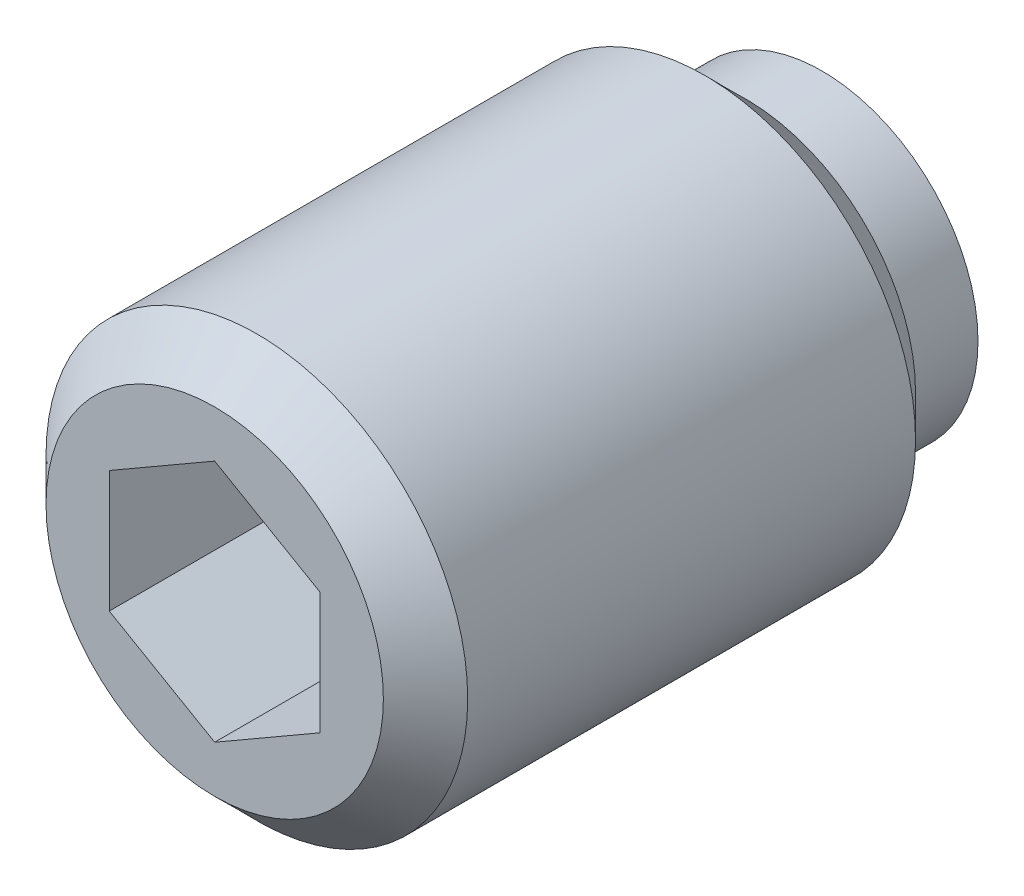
ISO-10303-21;
HEADER;
FILE_DESCRIPTION(('STEP AP214'),'2;1');
FILE_NAME('part.step','',(''),(''),'','','');
FILE_SCHEMA(('AUTOMOTIVE_DESIGN { 1 0 10303 214 1 1 1 1 }'));
ENDSEC;
DATA;
#1=APPLICATION_CONTEXT('core data for automotive mechanical design processes');
#2=APPLICATION_PROTOCOL_DEFINITION('international standard','automotive_design',2000,#1);
#3=PRODUCT_CONTEXT('',#1,'mechanical');
#4=PRODUCT('Part','Part','',(#3));
#5=PRODUCT_RELATED_PRODUCT_CATEGORY('part','',(#4));
#6=PRODUCT_DEFINITION_FORMATION('','',#4);
#7=PRODUCT_DEFINITION_CONTEXT('part definition',#1,'design');
#8=PRODUCT_DEFINITION('design','',#6,#7);
#9=PRODUCT_DEFINITION_SHAPE('','',#8);
#10=(LENGTH_UNIT() NAMED_UNIT(*) SI_UNIT(.MILLI.,.METRE.));
#11=(NAMED_UNIT(*) PLANE_ANGLE_UNIT() SI_UNIT($,.RADIAN.));
#12=(NAMED_UNIT(*) SI_UNIT($,.STERADIAN.) SOLID_ANGLE_UNIT());
#13=UNCERTAINTY_MEASURE_WITH_UNIT(LENGTH_MEASURE(1.E-05),#10,'distance_accuracy_value','');
#14=(GEOMETRIC_REPRESENTATION_CONTEXT(3) GLOBAL_UNCERTAINTY_ASSIGNED_CONTEXT((#13)) GLOBAL_UNIT_ASSIGNED_CONTEXT((#10,
#11,#12)) REPRESENTATION_CONTEXT('',''));
#15=CARTESIAN_POINT('',(0.,0.,0.));
#16=DIRECTION('',(0.,0.,1.));
#17=DIRECTION('',(1.,0.,0.));
#18=AXIS2_PLACEMENT_3D('',#15,#16,#17);
#19=CARTESIAN_POINT('',(1.25,-0.721687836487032,5.));
#20=DIRECTION('',(-0.5,0.866025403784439,0.));
#21=DIRECTION('',(0.866025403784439,0.5,0.));
#22=AXIS2_PLACEMENT_3D('',#19,#20,#21);
#23=PLANE('',#22);
#24=DIRECTION('',(0.866025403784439,0.5,0.));
#25=VECTOR('',#24,1.);
#26=CARTESIAN_POINT('',(1.25,-0.721687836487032,5.));
#27=LINE('',#26,#25);
#28=CARTESIAN_POINT('',(1.25,-0.721687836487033,5.));
#29=VERTEX_POINT('',#28);
#30=CARTESIAN_POINT('',(0.,-1.44337567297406,5.));
#31=VERTEX_POINT('',#30);
#32=EDGE_CURVE('E88',#29,#31,#27,.F.);
#33=ORIENTED_EDGE('',*,*,#32,.T.);
#34=DIRECTION('',(0.,0.,-1.));
#35=VECTOR('',#34,1.);
#36=CARTESIAN_POINT('',(0.,-1.44337567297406,5.));
#37=LINE('',#36,#35);
#38=CARTESIAN_POINT('',(0.,-1.44337567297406,8.));
#39=VERTEX_POINT('',#38);
#40=EDGE_CURVE('E86',#39,#31,#37,.T.);
#41=ORIENTED_EDGE('',*,*,#40,.F.);
#42=DIRECTION('',(0.866025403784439,0.5,0.));
#43=VECTOR('',#42,1.);
#44=CARTESIAN_POINT('',(1.25,-0.721687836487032,8.));
#45=LINE('',#44,#43);
#46=CARTESIAN_POINT('',(1.25,-0.721687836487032,8.));
#47=VERTEX_POINT('',#46);
#48=EDGE_CURVE('E71',#39,#47,#45,.T.);
#49=ORIENTED_EDGE('',*,*,#48,.T.);
#50=DIRECTION('',(0.,0.,1.));
#51=VECTOR('',#50,1.);
#52=CARTESIAN_POINT('',(1.25,-0.721687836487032,5.));
#53=LINE('',#52,#51);
#54=EDGE_CURVE('E83',#29,#47,#53,.T.);
#55=ORIENTED_EDGE('',*,*,#54,.F.);
#56=EDGE_LOOP('',(#33,#41,#49,#55));
#57=FACE_BOUND('',#56,.T.);
#58=ADVANCED_FACE('F14',(#57),#23,.T.);
#59=CARTESIAN_POINT('',(0.,-1.44337567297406,5.));
#60=DIRECTION('',(0.5,0.866025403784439,0.));
#61=DIRECTION('',(0.866025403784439,-0.5,0.));
#62=AXIS2_PLACEMENT_3D('',#59,#60,#61);
#63=PLANE('',#62);
#64=DIRECTION('',(-0.866025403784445,0.499999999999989,0.));
#65=VECTOR('',#64,1.);
#66=CARTESIAN_POINT('',(-0.625,-1.08253175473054,5.));
#67=LINE('',#66,#65);
#68=CARTESIAN_POINT('',(-1.25,-0.721687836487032,5.));
#69=VERTEX_POINT('',#68);
#70=EDGE_CURVE('E78',#31,#69,#67,.T.);
#71=ORIENTED_EDGE('',*,*,#70,.T.);
#72=DIRECTION('',(0.,0.,-1.));
#73=VECTOR('',#72,1.);
#74=CARTESIAN_POINT('',(-1.25,-0.721687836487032,5.));
#75=LINE('',#74,#73);
#76=CARTESIAN_POINT('',(-1.25,-0.721687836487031,8.));
#77=VERTEX_POINT('',#76);
#78=EDGE_CURVE('E95',#77,#69,#75,.T.);
#79=ORIENTED_EDGE('',*,*,#78,.F.);
#80=DIRECTION('',(0.866025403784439,-0.5,0.));
#81=VECTOR('',#80,1.);
#82=CARTESIAN_POINT('',(0.,-1.44337567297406,8.));
#83=LINE('',#82,#81);
#84=EDGE_CURVE('E101',#77,#39,#83,.T.);
#85=ORIENTED_EDGE('',*,*,#84,.T.);
#86=ORIENTED_EDGE('',*,*,#40,.T.);
#87=EDGE_LOOP('',(#71,#79,#85,#86));
#88=FACE_BOUND('',#87,.T.);
#89=ADVANCED_FACE('F140',(#88),#63,.T.);
#90=CARTESIAN_POINT('',(1.25,0.721687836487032,5.));
#91=DIRECTION('',(-1.,0.,0.));
#92=DIRECTION('',(0.,0.,1.));
#93=AXIS2_PLACEMENT_3D('',#90,#91,#92);
#94=PLANE('',#93);
#95=DIRECTION('',(0.,1.,0.));
#96=VECTOR('',#95,1.);
#97=CARTESIAN_POINT('',(1.25,0.721687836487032,5.));
#98=LINE('',#97,#96);
#99=CARTESIAN_POINT('',(1.25,0.721687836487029,5.));
#100=VERTEX_POINT('',#99);
#101=EDGE_CURVE('E77',#100,#29,#98,.F.);
#102=ORIENTED_EDGE('',*,*,#101,.T.);
#103=ORIENTED_EDGE('',*,*,#54,.T.);
#104=DIRECTION('',(0.,1.,0.));
#105=VECTOR('',#104,1.);
#106=CARTESIAN_POINT('',(1.25,0.721687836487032,8.));
#107=LINE('',#106,#105);
#108=CARTESIAN_POINT('',(1.25,0.721687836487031,8.));
#109=VERTEX_POINT('',#108);
#110=EDGE_CURVE('E67',#47,#109,#107,.T.);
#111=ORIENTED_EDGE('',*,*,#110,.T.);
#112=DIRECTION('',(0.,0.,-1.));
#113=VECTOR('',#112,1.);
#114=CARTESIAN_POINT('',(1.25,0.721687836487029,5.));
#115=LINE('',#114,#113);
#116=EDGE_CURVE('E133',#100,#109,#115,.F.);
#117=ORIENTED_EDGE('',*,*,#116,.F.);
#118=EDGE_LOOP('',(#102,#103,#111,#117));
#119=FACE_BOUND('',#118,.T.);
#120=ADVANCED_FACE('F91',(#119),#94,.T.);
#121=CARTESIAN_POINT('',(0.,1.85,0.8));
#122=DIRECTION('',(0.,0.,1.));
#123=DIRECTION('',(1.,0.,0.));
#124=AXIS2_PLACEMENT_3D('',#121,#122,#123);
#125=PLANE('',#124);
#126=CARTESIAN_POINT('',(0.,0.,0.8));
#127=DIRECTION('',(0.,0.,1.));
#128=DIRECTION('',(1.,0.,0.));
#129=AXIS2_PLACEMENT_3D('',#126,#127,#128);
#130=CIRCLE('',#129,1.85);
#131=CARTESIAN_POINT('',(1.85,0.,0.8));
#132=VERTEX_POINT('',#131);
#133=EDGE_CURVE('E20',#132,#132,#130,.T.);
#134=ORIENTED_EDGE('',*,*,#133,.F.);
#135=EDGE_LOOP('',(#134));
#136=FACE_BOUND('',#135,.T.);
#137=CARTESIAN_POINT('',(1.32664991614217,0.,0.8));
#138=CARTESIAN_POINT('',(1.32664480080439,-0.0745282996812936,0.8));
#139=CARTESIAN_POINT('',(1.32034002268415,-0.149134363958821,0.8));
#140=CARTESIAN_POINT('',(1.30158374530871,-0.259382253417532,0.8));
#141=CARTESIAN_POINT('',(1.2937715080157,-0.295884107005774,0.8));
#142=CARTESIAN_POINT('',(1.27509528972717,-0.368136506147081,0.8));
#143=CARTESIAN_POINT('',(1.26422861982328,-0.403886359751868,0.8));
#144=CARTESIAN_POINT('',(1.22718593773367,-0.509476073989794,0.8));
#145=CARTESIAN_POINT('',(1.19654247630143,-0.577800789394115,0.8));
#146=CARTESIAN_POINT('',(1.12420548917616,-0.708328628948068,0.8));
#147=CARTESIAN_POINT('',(1.08251174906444,-0.770531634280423,0.799999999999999));
#148=CARTESIAN_POINT('',(1.01262575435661,-0.857896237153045,0.8));
#149=CARTESIAN_POINT('',(0.988087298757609,-0.886044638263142,0.800000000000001));
#150=CARTESIAN_POINT('',(0.936753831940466,-0.940149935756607,0.799999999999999));
#151=CARTESIAN_POINT('',(0.909961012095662,-0.966108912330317,0.799999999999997));
#152=CARTESIAN_POINT('',(0.826418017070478,-1.0404719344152,0.800000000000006));
#153=CARTESIAN_POINT('',(0.766485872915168,-1.0853838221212,0.800000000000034));
#154=CARTESIAN_POINT('',(0.639963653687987,-1.16448278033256,0.800000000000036));
#155=CARTESIAN_POINT('',(0.57337370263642,-1.1986700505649,0.80000000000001));
#156=CARTESIAN_POINT('',(0.435391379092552,-1.25538638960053,0.79999999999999));
#157=CARTESIAN_POINT('',(0.363999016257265,-1.27791548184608,0.799999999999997));
#158=CARTESIAN_POINT('',(0.218447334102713,-1.31066641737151,0.800000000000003));
#159=CARTESIAN_POINT('',(0.144288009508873,-1.32088823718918,0.800000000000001));
#160=CARTESIAN_POINT('',(-0.00469460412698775,-1.32873695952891,0.799999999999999));
#161=CARTESIAN_POINT('',(-0.0795178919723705,-1.32636388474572,0.8));
#162=CARTESIAN_POINT('',(-0.227703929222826,-1.30908953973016,0.8));
#163=CARTESIAN_POINT('',(-0.301066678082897,-1.29418826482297,0.8));
#164=CARTESIAN_POINT('',(-0.444249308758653,-1.25228067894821,0.8));
#165=CARTESIAN_POINT('',(-0.514069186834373,-1.22527435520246,0.8));
#166=CARTESIAN_POINT('',(-0.648183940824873,-1.15992326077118,0.8));
#167=CARTESIAN_POINT('',(-0.712478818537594,-1.12157849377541,0.8));
#168=CARTESIAN_POINT('',(-0.833718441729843,-1.03463903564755,0.8));
#169=CARTESIAN_POINT('',(-0.890663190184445,-0.986044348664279,0.8));
#170=CARTESIAN_POINT('',(-0.995586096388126,-0.879984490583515,0.8));
#171=CARTESIAN_POINT('',(-1.04356425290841,-0.822519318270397,0.8));
#172=CARTESIAN_POINT('',(-1.12919201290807,-0.700349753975,0.8));
#173=CARTESIAN_POINT('',(-1.16684161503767,-0.635645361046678,0.8));
#174=CARTESIAN_POINT('',(-1.23074349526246,-0.500834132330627,0.8));
#175=CARTESIAN_POINT('',(-1.25699577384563,-0.43072729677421,0.8));
#176=CARTESIAN_POINT('',(-1.29735778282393,-0.287101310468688,0.8));
#177=CARTESIAN_POINT('',(-1.31146751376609,-0.213582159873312,0.8));
#178=CARTESIAN_POINT('',(-1.32714389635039,-0.065218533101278,0.8));
#179=CARTESIAN_POINT('',(-1.32871054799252,0.009625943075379,0.8));
#180=CARTESIAN_POINT('',(-1.31925629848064,0.158515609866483,0.8));
#181=CARTESIAN_POINT('',(-1.30823539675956,0.232560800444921,0.8));
#182=CARTESIAN_POINT('',(-1.27391889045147,0.377749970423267,0.8));
#183=CARTESIAN_POINT('',(-1.25062328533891,0.448893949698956,0.8));
#184=CARTESIAN_POINT('',(-1.1924186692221,0.586261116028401,0.8));
#185=CARTESIAN_POINT('',(-1.15750965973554,0.65248430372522,0.8));
#186=CARTESIAN_POINT('',(-1.07706920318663,0.778130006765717,0.8));
#187=CARTESIAN_POINT('',(-1.03153775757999,0.837552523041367,0.8));
#188=CARTESIAN_POINT('',(-0.931144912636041,0.94791008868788,0.8));
#189=CARTESIAN_POINT('',(-0.876283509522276,0.998845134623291,0.8));
#190=CARTESIAN_POINT('',(-0.758788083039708,1.09078183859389,0.8));
#191=CARTESIAN_POINT('',(-0.696154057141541,1.13178349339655,0.8));
#192=CARTESIAN_POINT('',(-0.564891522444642,1.20268947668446,0.8));
#193=CARTESIAN_POINT('',(-0.496263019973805,1.2325938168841,0.8));
#194=CARTESIAN_POINT('',(-0.354959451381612,1.28045618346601,0.8));
#195=CARTESIAN_POINT('',(-0.282284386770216,1.29841421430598,0.8));
#196=CARTESIAN_POINT('',(-0.134951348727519,1.32187476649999,0.8));
#197=CARTESIAN_POINT('',(-0.0602933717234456,1.32737726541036,0.8));
#198=CARTESIAN_POINT('',(0.0888888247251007,1.32576847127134,0.8));
#199=CARTESIAN_POINT('',(0.163413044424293,1.31865720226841,0.8));
#200=CARTESIAN_POINT('',(0.310201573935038,1.29203029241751,0.8));
#201=CARTESIAN_POINT('',(0.382465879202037,1.2725146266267,0.8));
#202=CARTESIAN_POINT('',(0.522725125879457,1.22160430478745,0.8));
#203=CARTESIAN_POINT('',(0.590719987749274,1.19020942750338,0.800000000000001));
#204=CARTESIAN_POINT('',(0.687959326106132,1.13494821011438,0.8));
#205=CARTESIAN_POINT('',(0.719585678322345,1.11516191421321,0.799999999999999));
#206=CARTESIAN_POINT('',(0.78109307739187,1.07297959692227,0.800000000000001));
#207=CARTESIAN_POINT('',(0.810972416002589,1.05058108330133,0.800000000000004));
#208=CARTESIAN_POINT('',(0.89757353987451,0.979751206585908,0.799999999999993));
#209=CARTESIAN_POINT('',(0.951346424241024,0.927635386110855,0.799999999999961));
#210=CARTESIAN_POINT('',(1.04936512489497,0.815107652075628,0.800000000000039));
#211=CARTESIAN_POINT('',(1.09361112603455,0.754695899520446,0.800000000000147));
#212=CARTESIAN_POINT('',(1.15190307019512,0.659179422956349,0.800000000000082));
#213=CARTESIAN_POINT('',(1.17000115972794,0.626490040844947,0.800000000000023));
#214=CARTESIAN_POINT('',(1.20336503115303,0.5597362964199,0.799999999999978));
#215=CARTESIAN_POINT('',(1.21863329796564,0.525673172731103,0.799999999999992));
#216=CARTESIAN_POINT('',(1.26001615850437,0.421779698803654,0.800000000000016));
#217=CARTESIAN_POINT('',(1.28177367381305,0.350138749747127,0.800000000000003));
#218=CARTESIAN_POINT('',(1.30709077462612,0.231713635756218,0.799999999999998));
#219=CARTESIAN_POINT('',(1.3144151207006,0.185685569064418,0.799999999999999));
#220=CARTESIAN_POINT('',(1.3241962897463,0.0931151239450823,0.800000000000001));
#221=CARTESIAN_POINT('',(1.32665311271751,0.0465727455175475,0.8));
#222=CARTESIAN_POINT('',(1.32664991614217,0.,0.8));
#223=B_SPLINE_CURVE_WITH_KNOTS('',3,(#137,#138,#139,#140,#141,#142,#143,#144,#145,#146,#147,
#148,#149,#150,#151,#152,#153,#154,#155,#156,#157,#158,#159,#160,#161,#162,#163,#164,#165,#166,
#167,#168,#169,#170,#171,#172,#173,#174,#175,#176,#177,#178,#179,#180,#181,#182,#183,#184,#185,
#186,#187,#188,#189,#190,#191,#192,#193,#194,#195,#196,#197,#198,#199,#200,#201,#202,#203,#204,
#205,#206,#207,#208,#209,#210,#211,#212,#213,#214,#215,#216,#217,#218,#219,#220,#221,#222),
.UNSPECIFIED.,.T.,.F.,(4,2,2,2,2,2,2,2,2,2,2,2,2,2,2,2,2,2,2,2,2,2,2,2,2,2,2,2,2,2,2,2,2,2,2,2,
2,2,2,2,2,2,4),(0.,0.223385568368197,0.335263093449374,0.447239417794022,0.670757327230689,
0.894279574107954,1.00619064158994,1.11799415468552,1.34151862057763,1.56503892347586,
1.78855877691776,2.0120790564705,2.23559893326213,2.45911889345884,2.68263908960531,
2.90615921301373,3.12967924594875,3.35319930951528,3.57671940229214,3.80023948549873,
4.02375955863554,4.24727963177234,4.47079971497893,4.69431980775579,4.91783987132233,
5.14135990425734,5.36488002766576,5.58840022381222,5.81192018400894,6.03544006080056,
6.25896034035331,6.48248019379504,6.7060004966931,6.92952496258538,7.04132847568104,
7.15323954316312,7.37676179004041,7.6002796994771,7.71225602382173,7.82413354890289,
8.04751911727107,8.18711279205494,8.3267064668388),.UNSPECIFIED.);
#224=CARTESIAN_POINT('',(1.32664991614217,0.,0.8));
#225=VERTEX_POINT('',#224);
#226=EDGE_CURVE('E89',#225,#225,#223,.T.);
#227=ORIENTED_EDGE('',*,*,#226,.F.);
#228=EDGE_LOOP('',(#227));
#229=FACE_BOUND('',#228,.T.);
#230=ADVANCED_FACE('F251',(#136,#229),#125,.F.);
#231=CARTESIAN_POINT('',(-1.25,-0.721687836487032,5.));
#232=DIRECTION('',(1.,0.,0.));
#233=DIRECTION('',(0.,0.,-1.));
#234=AXIS2_PLACEMENT_3D('',#231,#232,#233);
#235=PLANE('',#234);
#236=DIRECTION('',(0.,1.,0.));
#237=VECTOR('',#236,1.);
#238=CARTESIAN_POINT('',(-1.25,0.,5.));
#239=LINE('',#238,#237);
#240=CARTESIAN_POINT('',(-1.25,0.721687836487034,5.));
#241=VERTEX_POINT('',#240);
#242=EDGE_CURVE('E125',#69,#241,#239,.T.);
#243=ORIENTED_EDGE('',*,*,#242,.T.);
#244=DIRECTION('',(0.,0.,-1.));
#245=VECTOR('',#244,1.);
#246=CARTESIAN_POINT('',(-1.25,0.721687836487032,5.));
#247=LINE('',#246,#245);
#248=CARTESIAN_POINT('',(-1.25,0.721687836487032,8.));
#249=VERTEX_POINT('',#248);
#250=EDGE_CURVE('E121',#249,#241,#247,.T.);
#251=ORIENTED_EDGE('',*,*,#250,.F.);
#252=DIRECTION('',(0.,1.,0.));
#253=VECTOR('',#252,1.);
#254=CARTESIAN_POINT('',(-1.25,-0.721687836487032,8.));
#255=LINE('',#254,#253);
#256=EDGE_CURVE('E92',#249,#77,#255,.F.);
#257=ORIENTED_EDGE('',*,*,#256,.T.);
#258=ORIENTED_EDGE('',*,*,#78,.T.);
#259=EDGE_LOOP('',(#243,#251,#257,#258));
#260=FACE_BOUND('',#259,.T.);
#261=ADVANCED_FACE('F143',(#260),#235,.T.);
#262=CARTESIAN_POINT('',(0.,0.,5.));
#263=DIRECTION('',(0.,0.,-1.));
#264=DIRECTION('',(-1.,0.,0.));
#265=AXIS2_PLACEMENT_3D('',#262,#263,#264);
#266=PLANE('',#265);
#267=DIRECTION('',(-0.866025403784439,0.5,0.));
#268=VECTOR('',#267,1.);
#269=CARTESIAN_POINT('',(0.,1.44337567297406,5.));
#270=LINE('',#269,#268);
#271=CARTESIAN_POINT('',(0.,1.44337567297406,5.));
#272=VERTEX_POINT('',#271);
#273=EDGE_CURVE('E130',#272,#100,#270,.F.);
#274=ORIENTED_EDGE('',*,*,#273,.F.);
#275=DIRECTION('',(-0.866025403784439,-0.5,0.));
#276=VECTOR('',#275,1.);
#277=CARTESIAN_POINT('',(-1.25,0.721687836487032,5.));
#278=LINE('',#277,#276);
#279=EDGE_CURVE('E117',#241,#272,#278,.F.);
#280=ORIENTED_EDGE('',*,*,#279,.F.);
#281=ORIENTED_EDGE('',*,*,#242,.F.);
#282=ORIENTED_EDGE('',*,*,#70,.F.);
#283=ORIENTED_EDGE('',*,*,#32,.F.);
#284=ORIENTED_EDGE('',*,*,#101,.F.);
#285=EDGE_LOOP('',(#274,#280,#281,#282,#283,#284));
#286=FACE_BOUND('',#285,.T.);
#287=ADVANCED_FACE('F235',(#286),#266,.F.);
#288=CARTESIAN_POINT('',(0.,1.44337567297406,5.));
#289=DIRECTION('',(-0.5,-0.866025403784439,0.));
#290=DIRECTION('',(-0.866025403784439,0.5,0.));
#291=AXIS2_PLACEMENT_3D('',#288,#289,#290);
#292=PLANE('',#291);
#293=ORIENTED_EDGE('',*,*,#273,.T.);
#294=ORIENTED_EDGE('',*,*,#116,.T.);
#295=DIRECTION('',(-0.866025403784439,0.5,0.));
#296=VECTOR('',#295,1.);
#297=CARTESIAN_POINT('',(0.,1.44337567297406,8.));
#298=LINE('',#297,#296);
#299=CARTESIAN_POINT('',(0.,1.44337567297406,8.));
#300=VERTEX_POINT('',#299);
#301=EDGE_CURVE('E35',#109,#300,#298,.T.);
#302=ORIENTED_EDGE('',*,*,#301,.T.);
#303=DIRECTION('',(0.,0.,-1.));
#304=VECTOR('',#303,1.);
#305=CARTESIAN_POINT('',(0.,1.44337567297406,5.));
#306=LINE('',#305,#304);
#307=EDGE_CURVE('E112',#272,#300,#306,.F.);
#308=ORIENTED_EDGE('',*,*,#307,.F.);
#309=EDGE_LOOP('',(#293,#294,#302,#308));
#310=FACE_BOUND('',#309,.T.);
#311=ADVANCED_FACE('F156',(#310),#292,.T.);
#312=CARTESIAN_POINT('',(0.,0.,0.8));
#313=DIRECTION('',(0.,0.,1.));
#314=DIRECTION('',(1.,0.,0.));
#315=AXIS2_PLACEMENT_3D('',#312,#313,#314);
#316=CYLINDRICAL_SURFACE('',#315,1.85);
#317=CARTESIAN_POINT('',(0.,0.,1.7));
#318=DIRECTION('',(0.,0.,1.));
#319=DIRECTION('',(1.,0.,0.));
#320=AXIS2_PLACEMENT_3D('',#317,#318,#319);
#321=CIRCLE('',#320,1.85);
#322=CARTESIAN_POINT('',(1.85,0.,1.7));
#323=VERTEX_POINT('',#322);
#324=EDGE_CURVE('E110',#323,#323,#321,.F.);
#325=ORIENTED_EDGE('',*,*,#324,.T.);
#326=EDGE_LOOP('',(#325));
#327=FACE_BOUND('',#326,.T.);
#328=ORIENTED_EDGE('',*,*,#133,.T.);
#329=EDGE_LOOP('',(#328));
#330=FACE_BOUND('',#329,.T.);
#331=ADVANCED_FACE('F147',(#327,#330),#316,.T.);
#332=CARTESIAN_POINT('',(-1.25,0.721687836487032,5.));
#333=DIRECTION('',(0.5,-0.866025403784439,0.));
#334=DIRECTION('',(-0.866025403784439,-0.5,0.));
#335=AXIS2_PLACEMENT_3D('',#332,#333,#334);
#336=PLANE('',#335);
#337=ORIENTED_EDGE('',*,*,#279,.T.);
#338=ORIENTED_EDGE('',*,*,#307,.T.);
#339=DIRECTION('',(-0.86602540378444,-0.5,0.));
#340=VECTOR('',#339,1.);
#341=CARTESIAN_POINT('',(0.,1.44337567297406,8.));
#342=LINE('',#341,#340);
#343=EDGE_CURVE('E109',#300,#249,#342,.T.);
#344=ORIENTED_EDGE('',*,*,#343,.T.);
#345=ORIENTED_EDGE('',*,*,#250,.T.);
#346=EDGE_LOOP('',(#337,#338,#344,#345));
#347=FACE_BOUND('',#346,.T.);
#348=ADVANCED_FACE('F144',(#347),#336,.T.);
#349=CARTESIAN_POINT('',(0.,2.0095,1.7));
#350=DIRECTION('',(0.,0.,1.));
#351=DIRECTION('',(1.,0.,0.));
#352=AXIS2_PLACEMENT_3D('',#349,#350,#351);
#353=PLANE('',#352);
#354=CARTESIAN_POINT('',(0.,0.,1.69999999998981));
#355=DIRECTION('',(0.,0.,1.));
#356=DIRECTION('',(1.,0.,0.));
#357=AXIS2_PLACEMENT_3D('',#354,#355,#356);
#358=CIRCLE('',#357,2.00949999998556);
#359=CARTESIAN_POINT('',(2.00949999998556,0.,1.69999999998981));
#360=VERTEX_POINT('',#359);
#361=EDGE_CURVE('E107',#360,#360,#358,.T.);
#362=ORIENTED_EDGE('',*,*,#361,.F.);
#363=EDGE_LOOP('',(#362));
#364=FACE_BOUND('',#363,.T.);
#365=ORIENTED_EDGE('',*,*,#324,.F.);
#366=EDGE_LOOP('',(#365));
#367=FACE_BOUND('',#366,.T.);
#368=ADVANCED_FACE('F146',(#364,#367),#353,.F.);
#369=CARTESIAN_POINT('',(0.,0.,8.));
#370=DIRECTION('',(0.,0.,-1.));
#371=DIRECTION('',(-1.,0.,0.));
#372=AXIS2_PLACEMENT_3D('',#369,#370,#371);
#373=PLANE('',#372);
#374=ORIENTED_EDGE('',*,*,#301,.F.);
#375=ORIENTED_EDGE('',*,*,#110,.F.);
#376=ORIENTED_EDGE('',*,*,#48,.F.);
#377=ORIENTED_EDGE('',*,*,#84,.F.);
#378=ORIENTED_EDGE('',*,*,#256,.F.);
#379=ORIENTED_EDGE('',*,*,#343,.F.);
#380=EDGE_LOOP('',(#374,#375,#376,#377,#378,#379));
#381=FACE_BOUND('',#380,.T.);
#382=CARTESIAN_POINT('',(0.,0.,8.));
#383=DIRECTION('',(0.,0.,-1.));
#384=DIRECTION('',(-1.,0.,0.));
#385=AXIS2_PLACEMENT_3D('',#382,#383,#384);
#386=CIRCLE('',#385,1.9999999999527);
#387=CARTESIAN_POINT('',(-1.9999999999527,0.,8.));
#388=VERTEX_POINT('',#387);
#389=EDGE_CURVE('E104',#388,#388,#386,.T.);
#390=ORIENTED_EDGE('',*,*,#389,.F.);
#391=EDGE_LOOP('',(#390));
#392=FACE_BOUND('',#391,.T.);
#393=ADVANCED_FACE('F69',(#381,#392),#373,.F.);
#394=CARTESIAN_POINT('',(0.,0.,2.19049999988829));
#395=DIRECTION('',(0.,0.,1.));
#396=DIRECTION('',(1.,0.,0.));
#397=AXIS2_PLACEMENT_3D('',#394,#395,#396);
#398=CONICAL_SURFACE('',#397,2.49999999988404,0.785398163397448);
#399=CARTESIAN_POINT('',(0.,0.,2.1905));
#400=DIRECTION('',(0.,0.,1.));
#401=DIRECTION('',(1.,0.,0.));
#402=AXIS2_PLACEMENT_3D('',#399,#400,#401);
#403=CIRCLE('',#402,2.5);
#404=CARTESIAN_POINT('',(2.5,0.,2.1905));
#405=VERTEX_POINT('',#404);
#406=EDGE_CURVE('E26',#405,#405,#403,.T.);
#407=ORIENTED_EDGE('',*,*,#406,.F.);
#408=EDGE_LOOP('',(#407));
#409=FACE_BOUND('',#408,.T.);
#410=ORIENTED_EDGE('',*,*,#361,.T.);
#411=EDGE_LOOP('',(#410));
#412=FACE_BOUND('',#411,.T.);
#413=ADVANCED_FACE('F168',(#409,#412),#398,.T.);
#414=CARTESIAN_POINT('',(0.,0.,7.49999999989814));
#415=DIRECTION('',(0.,0.,-1.));
#416=DIRECTION('',(-1.,0.,0.));
#417=AXIS2_PLACEMENT_3D('',#414,#415,#416);
#418=CONICAL_SURFACE('',#417,2.50000000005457,0.785398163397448);
#419=ORIENTED_EDGE('',*,*,#389,.T.);
#420=EDGE_LOOP('',(#419));
#421=FACE_BOUND('',#420,.T.);
#422=CARTESIAN_POINT('',(0.,0.,7.5));
#423=DIRECTION('',(0.,0.,1.));
#424=DIRECTION('',(1.,0.,0.));
#425=AXIS2_PLACEMENT_3D('',#422,#423,#424);
#426=CIRCLE('',#425,2.5);
#427=CARTESIAN_POINT('',(2.5,0.,7.5));
#428=VERTEX_POINT('',#427);
#429=EDGE_CURVE('E9',#428,#428,#426,.F.);
#430=ORIENTED_EDGE('',*,*,#429,.F.);
#431=EDGE_LOOP('',(#430));
#432=FACE_BOUND('',#431,.T.);
#433=ADVANCED_FACE('F160',(#421,#432),#418,.T.);
#434=CARTESIAN_POINT('',(0.,0.,0.8));
#435=DIRECTION('',(0.,0.,1.));
#436=DIRECTION('',(1.,0.,0.));
#437=AXIS2_PLACEMENT_3D('',#434,#435,#436);
#438=CYLINDRICAL_SURFACE('',#437,2.5);
#439=ORIENTED_EDGE('',*,*,#429,.T.);
#440=EDGE_LOOP('',(#439));
#441=FACE_BOUND('',#440,.T.);
#442=ORIENTED_EDGE('',*,*,#406,.T.);
#443=EDGE_LOOP('',(#442));
#444=FACE_BOUND('',#443,.T.);
#445=ADVANCED_FACE('F158',(#441,#444),#438,.T.);
#446=CARTESIAN_POINT('',(0.,0.,1.5));
#447=DIRECTION('',(-1.,0.,0.));
#448=DIRECTION('',(0.,0.,1.));
#449=AXIS2_PLACEMENT_3D('',#446,#447,#448);
#450=SPHERICAL_SURFACE('',#449,1.5);
#451=ORIENTED_EDGE('',*,*,#226,.T.);
#452=EDGE_LOOP('',(#451));
#453=FACE_BOUND('',#452,.T.);
#454=ADVANCED_FACE('F16',(#453),#450,.T.);
#455=CLOSED_SHELL('',(#58,#89,#120,#230,#261,#287,#311,#331,#348,#368,#393,#413,#433,#445,#454));
#456=MANIFOLD_SOLID_BREP('B1',#455);
#457=ADVANCED_BREP_SHAPE_REPRESENTATION('',(#18,#456),#14);
#458=SHAPE_DEFINITION_REPRESENTATION(#9,#457);
ENDSEC;
END-ISO-10303-21;
